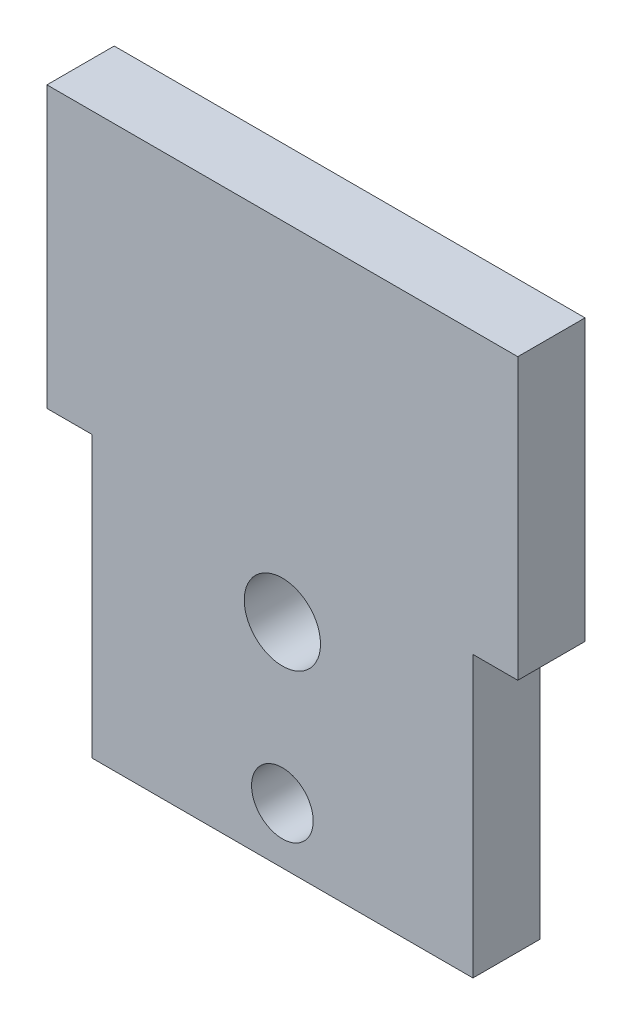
ISO-10303-21;
HEADER;
FILE_DESCRIPTION(('STEP AP214'),'2;1');
FILE_NAME('part.step','',(''),(''),'','','');
FILE_SCHEMA(('AUTOMOTIVE_DESIGN { 1 0 10303 214 1 1 1 1 }'));
ENDSEC;
DATA;
#1=APPLICATION_CONTEXT('core data for automotive mechanical design processes');
#2=APPLICATION_PROTOCOL_DEFINITION('international standard','automotive_design',2000,#1);
#3=PRODUCT_CONTEXT('',#1,'mechanical');
#4=PRODUCT('Part','Part','',(#3));
#5=PRODUCT_RELATED_PRODUCT_CATEGORY('part','',(#4));
#6=PRODUCT_DEFINITION_FORMATION('','',#4);
#7=PRODUCT_DEFINITION_CONTEXT('part definition',#1,'design');
#8=PRODUCT_DEFINITION('design','',#6,#7);
#9=PRODUCT_DEFINITION_SHAPE('','',#8);
#10=(LENGTH_UNIT() NAMED_UNIT(*) SI_UNIT(.MILLI.,.METRE.));
#11=(NAMED_UNIT(*) PLANE_ANGLE_UNIT() SI_UNIT($,.RADIAN.));
#12=(NAMED_UNIT(*) SI_UNIT($,.STERADIAN.) SOLID_ANGLE_UNIT());
#13=UNCERTAINTY_MEASURE_WITH_UNIT(LENGTH_MEASURE(1.E-05),#10,'distance_accuracy_value','');
#14=(GEOMETRIC_REPRESENTATION_CONTEXT(3) GLOBAL_UNCERTAINTY_ASSIGNED_CONTEXT((#13)) GLOBAL_UNIT_ASSIGNED_CONTEXT((#10,
#11,#12)) REPRESENTATION_CONTEXT('',''));
#15=CARTESIAN_POINT('',(0.,0.,0.));
#16=DIRECTION('',(0.,0.,1.));
#17=DIRECTION('',(1.,0.,0.));
#18=AXIS2_PLACEMENT_3D('',#15,#16,#17);
#19=CARTESIAN_POINT('',(0.,0.,6.));
#20=DIRECTION('',(0.,0.,-1.));
#21=DIRECTION('',(-1.,0.,0.));
#22=AXIS2_PLACEMENT_3D('',#19,#20,#21);
#23=PLANE('',#22);
#24=CARTESIAN_POINT('',(17.,19.,6.));
#25=DIRECTION('',(0.,0.,1.));
#26=DIRECTION('',(1.,0.,0.));
#27=AXIS2_PLACEMENT_3D('',#24,#25,#26);
#28=CIRCLE('',#27,3.4);
#29=CARTESIAN_POINT('',(20.4,19.,6.));
#30=VERTEX_POINT('',#29);
#31=EDGE_CURVE('E189',#30,#30,#28,.T.);
#32=ORIENTED_EDGE('',*,*,#31,.F.);
#33=EDGE_LOOP('',(#32));
#34=FACE_BOUND('',#33,.T.);
#35=DIRECTION('',(1.,0.,0.));
#36=VECTOR('',#35,1.);
#37=CARTESIAN_POINT('',(34.,0.,6.));
#38=LINE('',#37,#36);
#39=CARTESIAN_POINT('',(0.,0.,6.));
#40=VERTEX_POINT('',#39);
#41=CARTESIAN_POINT('',(34.,0.,6.));
#42=VERTEX_POINT('',#41);
#43=EDGE_CURVE('E147',#40,#42,#38,.T.);
#44=ORIENTED_EDGE('',*,*,#43,.T.);
#45=DIRECTION('',(0.,1.,0.));
#46=VECTOR('',#45,1.);
#47=CARTESIAN_POINT('',(34.,25.,6.));
#48=LINE('',#47,#46);
#49=CARTESIAN_POINT('',(34.,25.,6.));
#50=VERTEX_POINT('',#49);
#51=EDGE_CURVE('E95',#42,#50,#48,.T.);
#52=ORIENTED_EDGE('',*,*,#51,.T.);
#53=DIRECTION('',(1.,0.,0.));
#54=VECTOR('',#53,1.);
#55=CARTESIAN_POINT('',(38.,25.,6.));
#56=LINE('',#55,#54);
#57=CARTESIAN_POINT('',(38.,25.,6.));
#58=VERTEX_POINT('',#57);
#59=EDGE_CURVE('E162',#50,#58,#56,.T.);
#60=ORIENTED_EDGE('',*,*,#59,.T.);
#61=DIRECTION('',(0.,1.,0.));
#62=VECTOR('',#61,1.);
#63=CARTESIAN_POINT('',(38.,50.,6.));
#64=LINE('',#63,#62);
#65=CARTESIAN_POINT('',(38.,50.,6.));
#66=VERTEX_POINT('',#65);
#67=EDGE_CURVE('E175',#58,#66,#64,.T.);
#68=ORIENTED_EDGE('',*,*,#67,.T.);
#69=DIRECTION('',(-1.,0.,0.));
#70=VECTOR('',#69,1.);
#71=CARTESIAN_POINT('',(-4.,50.,6.));
#72=LINE('',#71,#70);
#73=CARTESIAN_POINT('',(-4.,50.,6.));
#74=VERTEX_POINT('',#73);
#75=EDGE_CURVE('E114',#66,#74,#72,.T.);
#76=ORIENTED_EDGE('',*,*,#75,.T.);
#77=DIRECTION('',(0.,-1.,0.));
#78=VECTOR('',#77,1.);
#79=CARTESIAN_POINT('',(-4.,25.,6.));
#80=LINE('',#79,#78);
#81=CARTESIAN_POINT('',(-4.,25.,6.));
#82=VERTEX_POINT('',#81);
#83=EDGE_CURVE('E108',#74,#82,#80,.T.);
#84=ORIENTED_EDGE('',*,*,#83,.T.);
#85=DIRECTION('',(1.,0.,0.));
#86=VECTOR('',#85,1.);
#87=CARTESIAN_POINT('',(0.,25.,6.));
#88=LINE('',#87,#86);
#89=CARTESIAN_POINT('',(0.,25.,6.));
#90=VERTEX_POINT('',#89);
#91=EDGE_CURVE('E112',#82,#90,#88,.T.);
#92=ORIENTED_EDGE('',*,*,#91,.T.);
#93=DIRECTION('',(0.,-1.,0.));
#94=VECTOR('',#93,1.);
#95=CARTESIAN_POINT('',(0.,0.,6.));
#96=LINE('',#95,#94);
#97=EDGE_CURVE('E52',#90,#40,#96,.T.);
#98=ORIENTED_EDGE('',*,*,#97,.T.);
#99=EDGE_LOOP('',(#44,#52,#60,#68,#76,#84,#92,#98));
#100=FACE_BOUND('',#99,.T.);
#101=CARTESIAN_POINT('',(17.,5.,6.));
#102=DIRECTION('',(0.,0.,1.));
#103=DIRECTION('',(1.,0.,0.));
#104=AXIS2_PLACEMENT_3D('',#101,#102,#103);
#105=CIRCLE('',#104,2.75);
#106=CARTESIAN_POINT('',(19.75,5.,6.));
#107=VERTEX_POINT('',#106);
#108=EDGE_CURVE('E136',#107,#107,#105,.T.);
#109=ORIENTED_EDGE('',*,*,#108,.F.);
#110=EDGE_LOOP('',(#109));
#111=FACE_BOUND('',#110,.T.);
#112=ADVANCED_FACE('F35',(#34,#100,#111),#23,.F.);
#113=CARTESIAN_POINT('',(0.,0.,0.));
#114=DIRECTION('',(0.,0.,-1.));
#115=DIRECTION('',(-1.,0.,0.));
#116=AXIS2_PLACEMENT_3D('',#113,#114,#115);
#117=PLANE('',#116);
#118=CARTESIAN_POINT('',(17.,19.,0.));
#119=DIRECTION('',(0.,0.,1.));
#120=DIRECTION('',(1.,0.,0.));
#121=AXIS2_PLACEMENT_3D('',#118,#119,#120);
#122=CIRCLE('',#121,3.4);
#123=CARTESIAN_POINT('',(20.4,19.,0.));
#124=VERTEX_POINT('',#123);
#125=EDGE_CURVE('E184',#124,#124,#122,.T.);
#126=ORIENTED_EDGE('',*,*,#125,.T.);
#127=EDGE_LOOP('',(#126));
#128=FACE_BOUND('',#127,.T.);
#129=DIRECTION('',(1.,0.,0.));
#130=VECTOR('',#129,1.);
#131=CARTESIAN_POINT('',(34.,0.,0.));
#132=LINE('',#131,#130);
#133=CARTESIAN_POINT('',(0.,0.,0.));
#134=VERTEX_POINT('',#133);
#135=CARTESIAN_POINT('',(34.,0.,0.));
#136=VERTEX_POINT('',#135);
#137=EDGE_CURVE('E132',#134,#136,#132,.T.);
#138=ORIENTED_EDGE('',*,*,#137,.F.);
#139=DIRECTION('',(0.,-1.,0.));
#140=VECTOR('',#139,1.);
#141=CARTESIAN_POINT('',(0.,0.,0.));
#142=LINE('',#141,#140);
#143=CARTESIAN_POINT('',(0.,25.,0.));
#144=VERTEX_POINT('',#143);
#145=EDGE_CURVE('E87',#144,#134,#142,.T.);
#146=ORIENTED_EDGE('',*,*,#145,.F.);
#147=DIRECTION('',(1.,0.,0.));
#148=VECTOR('',#147,1.);
#149=CARTESIAN_POINT('',(0.,25.,0.));
#150=LINE('',#149,#148);
#151=CARTESIAN_POINT('',(-4.,25.,0.));
#152=VERTEX_POINT('',#151);
#153=EDGE_CURVE('E81',#152,#144,#150,.T.);
#154=ORIENTED_EDGE('',*,*,#153,.F.);
#155=DIRECTION('',(0.,-1.,0.));
#156=VECTOR('',#155,1.);
#157=CARTESIAN_POINT('',(-4.,25.,0.));
#158=LINE('',#157,#156);
#159=CARTESIAN_POINT('',(-4.,50.,0.));
#160=VERTEX_POINT('',#159);
#161=EDGE_CURVE('E122',#160,#152,#158,.T.);
#162=ORIENTED_EDGE('',*,*,#161,.F.);
#163=DIRECTION('',(-1.,0.,0.));
#164=VECTOR('',#163,1.);
#165=CARTESIAN_POINT('',(-4.,50.,0.));
#166=LINE('',#165,#164);
#167=CARTESIAN_POINT('',(38.,50.,0.));
#168=VERTEX_POINT('',#167);
#169=EDGE_CURVE('E142',#168,#160,#166,.T.);
#170=ORIENTED_EDGE('',*,*,#169,.F.);
#171=DIRECTION('',(0.,1.,0.));
#172=VECTOR('',#171,1.);
#173=CARTESIAN_POINT('',(38.,50.,0.));
#174=LINE('',#173,#172);
#175=CARTESIAN_POINT('',(38.,25.,0.));
#176=VERTEX_POINT('',#175);
#177=EDGE_CURVE('E140',#176,#168,#174,.T.);
#178=ORIENTED_EDGE('',*,*,#177,.F.);
#179=DIRECTION('',(1.,0.,0.));
#180=VECTOR('',#179,1.);
#181=CARTESIAN_POINT('',(38.,25.,0.));
#182=LINE('',#181,#180);
#183=CARTESIAN_POINT('',(34.,25.,0.));
#184=VERTEX_POINT('',#183);
#185=EDGE_CURVE('E138',#184,#176,#182,.T.);
#186=ORIENTED_EDGE('',*,*,#185,.F.);
#187=DIRECTION('',(0.,1.,0.));
#188=VECTOR('',#187,1.);
#189=CARTESIAN_POINT('',(34.,25.,0.));
#190=LINE('',#189,#188);
#191=EDGE_CURVE('E135',#136,#184,#190,.T.);
#192=ORIENTED_EDGE('',*,*,#191,.F.);
#193=EDGE_LOOP('',(#138,#146,#154,#162,#170,#178,#186,#192));
#194=FACE_BOUND('',#193,.T.);
#195=CARTESIAN_POINT('',(17.,5.,0.));
#196=DIRECTION('',(0.,0.,1.));
#197=DIRECTION('',(1.,0.,0.));
#198=AXIS2_PLACEMENT_3D('',#195,#196,#197);
#199=CIRCLE('',#198,2.75);
#200=CARTESIAN_POINT('',(19.75,5.,0.));
#201=VERTEX_POINT('',#200);
#202=EDGE_CURVE('E181',#201,#201,#199,.T.);
#203=ORIENTED_EDGE('',*,*,#202,.T.);
#204=EDGE_LOOP('',(#203));
#205=FACE_BOUND('',#204,.T.);
#206=ADVANCED_FACE('F166',(#128,#194,#205),#117,.T.);
#207=CARTESIAN_POINT('',(34.,0.,6.));
#208=DIRECTION('',(0.,1.,0.));
#209=DIRECTION('',(-1.,0.,0.));
#210=AXIS2_PLACEMENT_3D('',#207,#208,#209);
#211=PLANE('',#210);
#212=ORIENTED_EDGE('',*,*,#137,.T.);
#213=DIRECTION('',(0.,0.,-1.));
#214=VECTOR('',#213,1.);
#215=CARTESIAN_POINT('',(34.,0.,6.));
#216=LINE('',#215,#214);
#217=EDGE_CURVE('E11',#42,#136,#216,.T.);
#218=ORIENTED_EDGE('',*,*,#217,.F.);
#219=ORIENTED_EDGE('',*,*,#43,.F.);
#220=DIRECTION('',(0.,0.,-1.));
#221=VECTOR('',#220,1.);
#222=CARTESIAN_POINT('',(0.,0.,6.));
#223=LINE('',#222,#221);
#224=EDGE_CURVE('E128',#40,#134,#223,.T.);
#225=ORIENTED_EDGE('',*,*,#224,.T.);
#226=EDGE_LOOP('',(#212,#218,#219,#225));
#227=FACE_BOUND('',#226,.T.);
#228=ADVANCED_FACE('F37',(#227),#211,.F.);
#229=CARTESIAN_POINT('',(34.,25.,6.));
#230=DIRECTION('',(-1.,0.,0.));
#231=DIRECTION('',(0.,-1.,0.));
#232=AXIS2_PLACEMENT_3D('',#229,#230,#231);
#233=PLANE('',#232);
#234=ORIENTED_EDGE('',*,*,#191,.T.);
#235=DIRECTION('',(0.,0.,-1.));
#236=VECTOR('',#235,1.);
#237=CARTESIAN_POINT('',(34.,25.,6.));
#238=LINE('',#237,#236);
#239=EDGE_CURVE('E44',#50,#184,#238,.T.);
#240=ORIENTED_EDGE('',*,*,#239,.F.);
#241=ORIENTED_EDGE('',*,*,#51,.F.);
#242=ORIENTED_EDGE('',*,*,#217,.T.);
#243=EDGE_LOOP('',(#234,#240,#241,#242));
#244=FACE_BOUND('',#243,.T.);
#245=ADVANCED_FACE('F218',(#244),#233,.F.);
#246=CARTESIAN_POINT('',(38.,25.,6.));
#247=DIRECTION('',(0.,1.,0.));
#248=DIRECTION('',(0.,0.,1.));
#249=AXIS2_PLACEMENT_3D('',#246,#247,#248);
#250=PLANE('',#249);
#251=ORIENTED_EDGE('',*,*,#185,.T.);
#252=DIRECTION('',(0.,0.,-1.));
#253=VECTOR('',#252,1.);
#254=CARTESIAN_POINT('',(38.,25.,6.));
#255=LINE('',#254,#253);
#256=EDGE_CURVE('E154',#58,#176,#255,.T.);
#257=ORIENTED_EDGE('',*,*,#256,.F.);
#258=ORIENTED_EDGE('',*,*,#59,.F.);
#259=ORIENTED_EDGE('',*,*,#239,.T.);
#260=EDGE_LOOP('',(#251,#257,#258,#259));
#261=FACE_BOUND('',#260,.T.);
#262=ADVANCED_FACE('F160',(#261),#250,.F.);
#263=CARTESIAN_POINT('',(38.,50.,6.));
#264=DIRECTION('',(-1.,0.,0.));
#265=DIRECTION('',(0.,0.,1.));
#266=AXIS2_PLACEMENT_3D('',#263,#264,#265);
#267=PLANE('',#266);
#268=ORIENTED_EDGE('',*,*,#177,.T.);
#269=DIRECTION('',(0.,0.,-1.));
#270=VECTOR('',#269,1.);
#271=CARTESIAN_POINT('',(38.,50.,6.));
#272=LINE('',#271,#270);
#273=EDGE_CURVE('E151',#66,#168,#272,.T.);
#274=ORIENTED_EDGE('',*,*,#273,.F.);
#275=ORIENTED_EDGE('',*,*,#67,.F.);
#276=ORIENTED_EDGE('',*,*,#256,.T.);
#277=EDGE_LOOP('',(#268,#274,#275,#276));
#278=FACE_BOUND('',#277,.T.);
#279=ADVANCED_FACE('F171',(#278),#267,.F.);
#280=CARTESIAN_POINT('',(-4.,50.,6.));
#281=DIRECTION('',(0.,-1.,0.));
#282=DIRECTION('',(0.,0.,-1.));
#283=AXIS2_PLACEMENT_3D('',#280,#281,#282);
#284=PLANE('',#283);
#285=ORIENTED_EDGE('',*,*,#169,.T.);
#286=DIRECTION('',(0.,0.,-1.));
#287=VECTOR('',#286,1.);
#288=CARTESIAN_POINT('',(-4.,50.,6.));
#289=LINE('',#288,#287);
#290=EDGE_CURVE('E123',#74,#160,#289,.T.);
#291=ORIENTED_EDGE('',*,*,#290,.F.);
#292=ORIENTED_EDGE('',*,*,#75,.F.);
#293=ORIENTED_EDGE('',*,*,#273,.T.);
#294=EDGE_LOOP('',(#285,#291,#292,#293));
#295=FACE_BOUND('',#294,.T.);
#296=ADVANCED_FACE('F174',(#295),#284,.F.);
#297=CARTESIAN_POINT('',(-4.,25.,6.));
#298=DIRECTION('',(1.,0.,0.));
#299=DIRECTION('',(0.,0.,-1.));
#300=AXIS2_PLACEMENT_3D('',#297,#298,#299);
#301=PLANE('',#300);
#302=ORIENTED_EDGE('',*,*,#161,.T.);
#303=DIRECTION('',(0.,0.,-1.));
#304=VECTOR('',#303,1.);
#305=CARTESIAN_POINT('',(-4.,25.,6.));
#306=LINE('',#305,#304);
#307=EDGE_CURVE('E119',#82,#152,#306,.T.);
#308=ORIENTED_EDGE('',*,*,#307,.F.);
#309=ORIENTED_EDGE('',*,*,#83,.F.);
#310=ORIENTED_EDGE('',*,*,#290,.T.);
#311=EDGE_LOOP('',(#302,#308,#309,#310));
#312=FACE_BOUND('',#311,.T.);
#313=ADVANCED_FACE('F120',(#312),#301,.F.);
#314=CARTESIAN_POINT('',(0.,25.,6.));
#315=DIRECTION('',(0.,1.,0.));
#316=DIRECTION('',(0.,0.,1.));
#317=AXIS2_PLACEMENT_3D('',#314,#315,#316);
#318=PLANE('',#317);
#319=ORIENTED_EDGE('',*,*,#153,.T.);
#320=DIRECTION('',(0.,0.,-1.));
#321=VECTOR('',#320,1.);
#322=CARTESIAN_POINT('',(0.,25.,6.));
#323=LINE('',#322,#321);
#324=EDGE_CURVE('E124',#90,#144,#323,.T.);
#325=ORIENTED_EDGE('',*,*,#324,.F.);
#326=ORIENTED_EDGE('',*,*,#91,.F.);
#327=ORIENTED_EDGE('',*,*,#307,.T.);
#328=EDGE_LOOP('',(#319,#325,#326,#327));
#329=FACE_BOUND('',#328,.T.);
#330=ADVANCED_FACE('F126',(#329),#318,.F.);
#331=CARTESIAN_POINT('',(0.,0.,6.));
#332=DIRECTION('',(1.,0.,0.));
#333=DIRECTION('',(0.,0.,-1.));
#334=AXIS2_PLACEMENT_3D('',#331,#332,#333);
#335=PLANE('',#334);
#336=ORIENTED_EDGE('',*,*,#145,.T.);
#337=ORIENTED_EDGE('',*,*,#224,.F.);
#338=ORIENTED_EDGE('',*,*,#97,.F.);
#339=ORIENTED_EDGE('',*,*,#324,.T.);
#340=EDGE_LOOP('',(#336,#337,#338,#339));
#341=FACE_BOUND('',#340,.T.);
#342=ADVANCED_FACE('F206',(#341),#335,.F.);
#343=CARTESIAN_POINT('',(17.,5.,6.));
#344=DIRECTION('',(0.,0.,-1.));
#345=DIRECTION('',(-1.,0.,0.));
#346=AXIS2_PLACEMENT_3D('',#343,#344,#345);
#347=CYLINDRICAL_SURFACE('',#346,2.75);
#348=ORIENTED_EDGE('',*,*,#108,.T.);
#349=EDGE_LOOP('',(#348));
#350=FACE_BOUND('',#349,.T.);
#351=ORIENTED_EDGE('',*,*,#202,.F.);
#352=EDGE_LOOP('',(#351));
#353=FACE_BOUND('',#352,.T.);
#354=ADVANCED_FACE('F203',(#350,#353),#347,.F.);
#355=CARTESIAN_POINT('',(17.,19.,6.));
#356=DIRECTION('',(0.,0.,1.));
#357=DIRECTION('',(1.,0.,0.));
#358=AXIS2_PLACEMENT_3D('',#355,#356,#357);
#359=CYLINDRICAL_SURFACE('',#358,3.4);
#360=ORIENTED_EDGE('',*,*,#125,.F.);
#361=EDGE_LOOP('',(#360));
#362=FACE_BOUND('',#361,.T.);
#363=ORIENTED_EDGE('',*,*,#31,.T.);
#364=EDGE_LOOP('',(#363));
#365=FACE_BOUND('',#364,.T.);
#366=ADVANCED_FACE('F193',(#362,#365),#359,.F.);
#367=CLOSED_SHELL('',(#112,#206,#228,#245,#262,#279,#296,#313,#330,#342,#354,#366));
#368=MANIFOLD_SOLID_BREP('B2',#367);
#369=ADVANCED_BREP_SHAPE_REPRESENTATION('',(#18,#368),#14);
#370=SHAPE_DEFINITION_REPRESENTATION(#9,#369);
ENDSEC;
END-ISO-10303-21;
